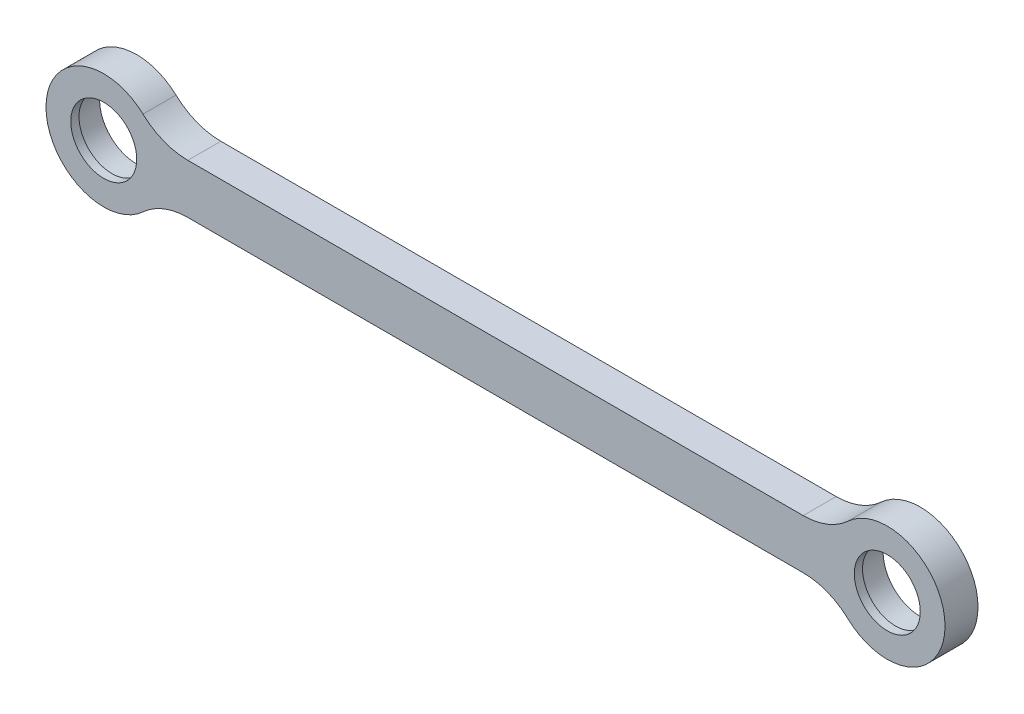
from build123d import *

# Parameters (mm, degrees)
SKETCH_1_R          = 2.1
EXTRUDE_1_DEPTH     = 4
FILLET_1_R          = 8
SKETCH_2_R          = 4.5
CUT_EXTRUDE_1_DEPTH = 4
SKETCH_3_R          = 4.5
SKETCH_3_R_2        = 4
EXTRUDE_2_DEPTH     = 1


with BuildPart() as part:
    # Sketch 1 → Extrude 1 (new body)
    with BuildSketch(Plane.XY):
        with BuildLine():
            Line((6.32455532, 3), (88.67544468, 3))
            ThreePointArc((88.67544468, 3), (102, 0), (88.67544468, -3))
            Line((88.67544468, -3), (6.32455532, -3))
            ThreePointArc((6.32455532, -3), (-7, 0), (6.32455532, 3))
        make_face()
        Circle(SKETCH_1_R, mode=Mode.SUBTRACT)
        with Locations((95, 0)):
            Circle(SKETCH_1_R, mode=Mode.SUBTRACT)
    extrude(amount=EXTRUDE_1_DEPTH)

    # Fillet 1
    fillet_1_edges = [part.edges().sort_by_distance(p)[0] for p in [
        (6.32455532, 3, 2),
        (88.67544468, 3, 2),
        (88.67544468, -3, 2),
        (6.32455532, -3, 2),
    ]]
    fillet(fillet_1_edges, radius=FILLET_1_R)

    # Sketch 2 → Cut-Extrude 1 (cut)
    with BuildSketch(Plane.XY.offset(4)):
        Circle(SKETCH_2_R)
        with Locations((95, 0)):
            Circle(SKETCH_2_R)
    extrude(amount=-CUT_EXTRUDE_1_DEPTH, mode=Mode.SUBTRACT)

    # Sketch 3 → Extrude 2 (add)
    # profile 1 of 2: a face of its own
    with BuildSketch(Plane.XY.offset(4)):
        with Locations((95, 0)):
            Circle(SKETCH_3_R)
        with Locations((95, 0)):
            Circle(SKETCH_3_R_2, mode=Mode.SUBTRACT)
    # profile 2 of 2: a face of its own
    with BuildSketch(Plane.XY.offset(4)):
        Circle(SKETCH_3_R)
        Circle(SKETCH_3_R_2, mode=Mode.SUBTRACT)
    extrude(amount=-EXTRUDE_2_DEPTH)


solid = part.part
